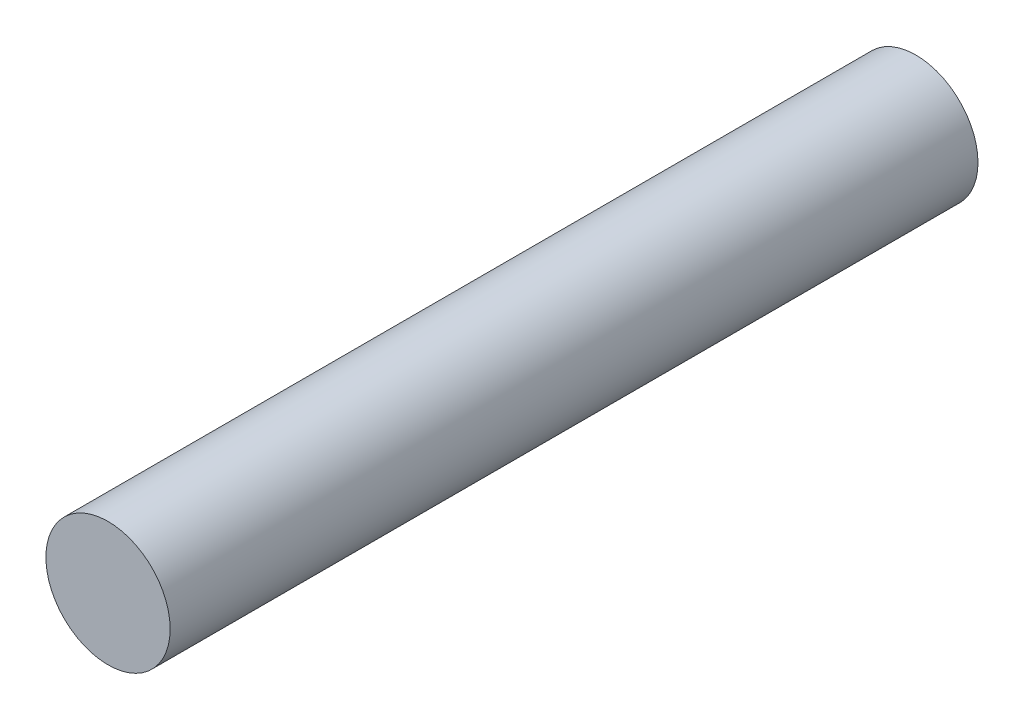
ISO-10303-21;
HEADER;
FILE_DESCRIPTION(('STEP AP214'),'2;1');
FILE_NAME('part.step','',(''),(''),'','','');
FILE_SCHEMA(('AUTOMOTIVE_DESIGN { 1 0 10303 214 1 1 1 1 }'));
ENDSEC;
DATA;
#1=APPLICATION_CONTEXT('core data for automotive mechanical design processes');
#2=APPLICATION_PROTOCOL_DEFINITION('international standard','automotive_design',2000,#1);
#3=PRODUCT_CONTEXT('',#1,'mechanical');
#4=PRODUCT('Part','Part','',(#3));
#5=PRODUCT_RELATED_PRODUCT_CATEGORY('part','',(#4));
#6=PRODUCT_DEFINITION_FORMATION('','',#4);
#7=PRODUCT_DEFINITION_CONTEXT('part definition',#1,'design');
#8=PRODUCT_DEFINITION('design','',#6,#7);
#9=PRODUCT_DEFINITION_SHAPE('','',#8);
#10=(LENGTH_UNIT() NAMED_UNIT(*) SI_UNIT(.MILLI.,.METRE.));
#11=(NAMED_UNIT(*) PLANE_ANGLE_UNIT() SI_UNIT($,.RADIAN.));
#12=(NAMED_UNIT(*) SI_UNIT($,.STERADIAN.) SOLID_ANGLE_UNIT());
#13=UNCERTAINTY_MEASURE_WITH_UNIT(LENGTH_MEASURE(1.E-05),#10,'distance_accuracy_value','');
#14=(GEOMETRIC_REPRESENTATION_CONTEXT(3) GLOBAL_UNCERTAINTY_ASSIGNED_CONTEXT((#13)) GLOBAL_UNIT_ASSIGNED_CONTEXT((#10,
#11,#12)) REPRESENTATION_CONTEXT('',''));
#15=CARTESIAN_POINT('',(0.,0.,0.));
#16=DIRECTION('',(0.,0.,1.));
#17=DIRECTION('',(1.,0.,0.));
#18=AXIS2_PLACEMENT_3D('',#15,#16,#17);
#19=CARTESIAN_POINT('',(0.,0.,-152.4));
#20=DIRECTION('',(0.,0.,1.));
#21=DIRECTION('',(1.,0.,0.));
#22=AXIS2_PLACEMENT_3D('',#19,#20,#21);
#23=CYLINDRICAL_SURFACE('',#22,12.7);
#24=CARTESIAN_POINT('',(0.,0.,-152.4));
#25=DIRECTION('',(0.,0.,1.));
#26=DIRECTION('',(1.,0.,0.));
#27=AXIS2_PLACEMENT_3D('',#24,#25,#26);
#28=CIRCLE('',#27,12.7);
#29=CARTESIAN_POINT('',(12.7,0.,-152.4));
#30=VERTEX_POINT('',#29);
#31=EDGE_CURVE('E10',#30,#30,#28,.T.);
#32=ORIENTED_EDGE('',*,*,#31,.T.);
#33=EDGE_LOOP('',(#32));
#34=FACE_BOUND('',#33,.T.);
#35=CARTESIAN_POINT('',(0.,0.,12.7));
#36=DIRECTION('',(0.,0.,1.));
#37=DIRECTION('',(1.,0.,0.));
#38=AXIS2_PLACEMENT_3D('',#35,#36,#37);
#39=CIRCLE('',#38,12.7);
#40=CARTESIAN_POINT('',(12.7,0.,12.7));
#41=VERTEX_POINT('',#40);
#42=EDGE_CURVE('E33',#41,#41,#39,.T.);
#43=ORIENTED_EDGE('',*,*,#42,.F.);
#44=EDGE_LOOP('',(#43));
#45=FACE_BOUND('',#44,.T.);
#46=ADVANCED_FACE('F27',(#34,#45),#23,.T.);
#47=CARTESIAN_POINT('',(0.,0.,-152.4));
#48=DIRECTION('',(0.,0.,1.));
#49=DIRECTION('',(1.,0.,0.));
#50=AXIS2_PLACEMENT_3D('',#47,#48,#49);
#51=PLANE('',#50);
#52=ORIENTED_EDGE('',*,*,#31,.F.);
#53=EDGE_LOOP('',(#52));
#54=FACE_BOUND('',#53,.T.);
#55=ADVANCED_FACE('F42',(#54),#51,.F.);
#56=CARTESIAN_POINT('',(0.,0.,12.7));
#57=DIRECTION('',(0.,0.,1.));
#58=DIRECTION('',(1.,0.,0.));
#59=AXIS2_PLACEMENT_3D('',#56,#57,#58);
#60=PLANE('',#59);
#61=ORIENTED_EDGE('',*,*,#42,.T.);
#62=EDGE_LOOP('',(#61));
#63=FACE_BOUND('',#62,.T.);
#64=ADVANCED_FACE('F39',(#63),#60,.T.);
#65=CLOSED_SHELL('',(#46,#55,#64));
#66=MANIFOLD_SOLID_BREP('B2',#65);
#67=ADVANCED_BREP_SHAPE_REPRESENTATION('',(#18,#66),#14);
#68=SHAPE_DEFINITION_REPRESENTATION(#9,#67);
ENDSEC;
END-ISO-10303-21;
